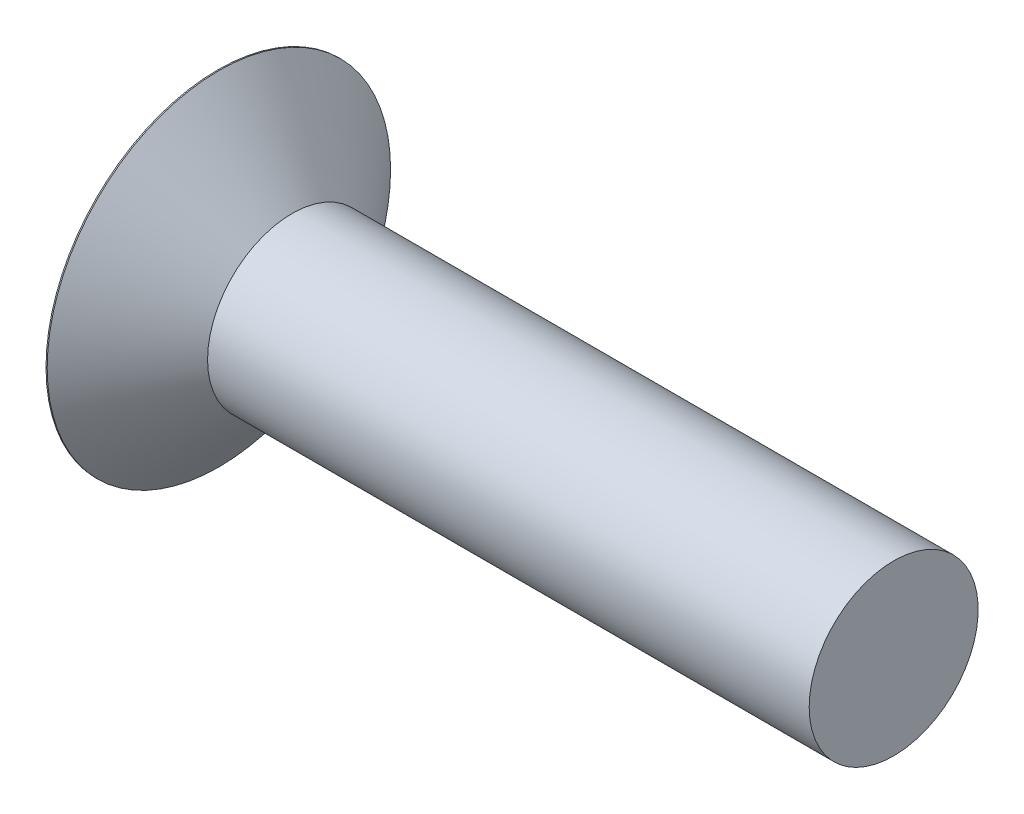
from build123d import *

# Parameters (mm, degrees)
CIRPATTERN1_COUNT = 2
CIRPATTERN1_ANGLE = 90


with BuildPart() as part:
    # BodySke → Base-Revolve (revolve)
    with BuildSketch(Plane.XY, mode=Mode.PRIVATE) as base_revolve_sk:
        Polygon((0, 0), (0, 9.6774), (0.066909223, 9.6774), (4.191, 4.7625), (38.1, 4.7625), (38.1, 0), align=None)
    revolve(base_revolve_sk.sketch.rotate(Axis((-6.35, 0, 0), (1, 0, 0)), 90), axis=Axis((-6.35, 0, 0), (1, 0, 0)))

    # Sketch3 → Cross section 0
    with BuildSketch(Plane.ZY):
        with BuildLine():
            Line((-1.0922, 6.6421), (1.0922, 6.6421))
            Line((1.0922, 6.6421), (1.0922, -6.6421))
            Line((1.0922, -6.6421), (-1.0922, -6.6421))
            Line((-1.0922, -6.6421), (-1.0922, 6.6421))
        make_face()
    # Sketch4 → Cross section 1
    with BuildSketch(Plane.ZY.offset(-7.9756)):
        with BuildLine():
            Line((-0.5461, 0.5461), (0.5461, 0.5461))
            Line((0.5461, 0.5461), (0.5461, -0.5461))
            Line((0.5461, -0.5461), (-0.5461, -0.5461))
            Line((-0.5461, -0.5461), (-0.5461, 0.5461))
        make_face()
    cross = loft(mode=Mode.SUBTRACT)

    # CirPattern1: Cross ×2 about axis
    cirpattern1_axis = Axis((0, 0, 0), (1, 0, 0))
    for i in range(1, CIRPATTERN1_COUNT):
        add(cross.rotate(cirpattern1_axis, i * CIRPATTERN1_ANGLE / (CIRPATTERN1_COUNT - 1)), mode=Mode.SUBTRACT)


solid = part.part
